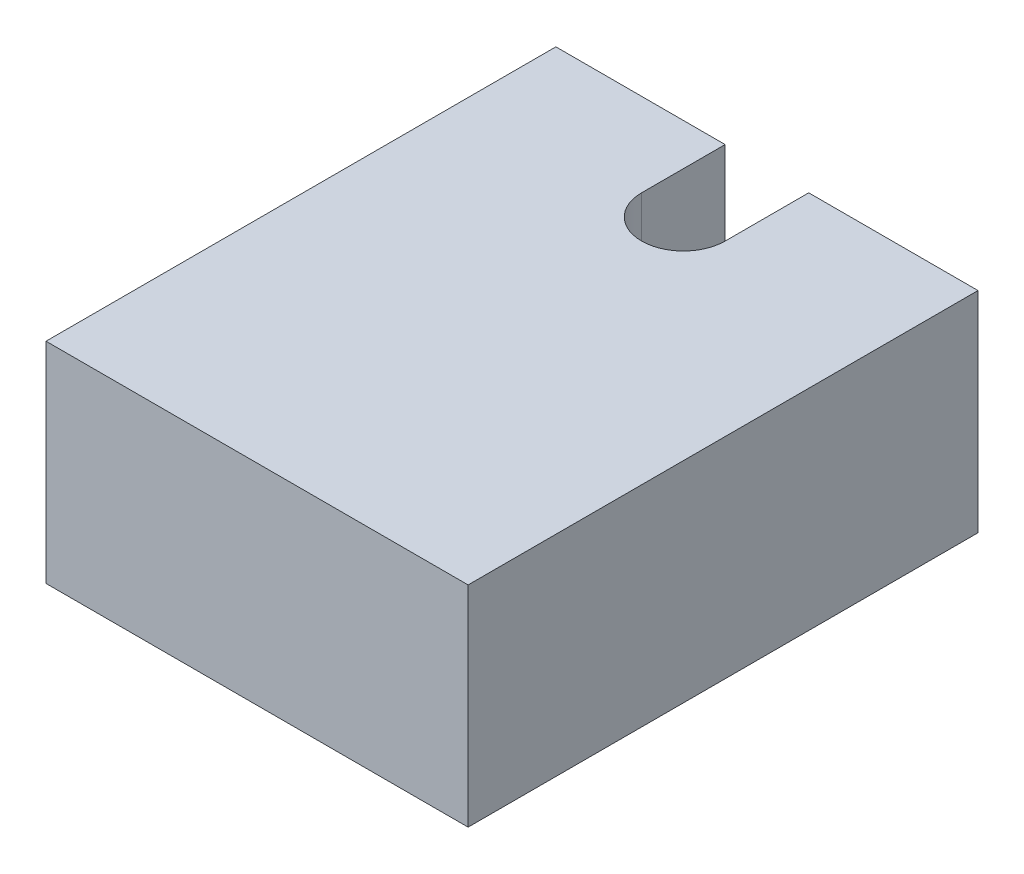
from build123d import *

# Parameters (mm, degrees)
EXTRUSION1_DEPTH = 2.51
ESQUISSE2_R      = 0.25
EXTRUSION2_DEPTH = 1


with BuildPart() as part:
    # Esquisse1 → Extrusion1 (new body)
    with BuildSketch(Plane(origin=(0, 0, 0), x_dir=(1, 0, 0), z_dir=(0, 1, 0))):
        with BuildLine():
            Line((3.025, 5.1), (3.025, 6.1))
            Line((3.025, 6.1), (5.05, 6.1))
            Line((5.05, 6.1), (5.05, 0))
            Line((5.05, 0), (0, 0))
            Line((0, 0), (0, 6.1))
            Line((0, 6.1), (2.025, 6.1))
            Line((2.025, 6.1), (2.025, 5.1))
            ThreePointArc((2.025, 5.1), (2.525, 4.6), (3.025, 5.1))
        make_face()
    extrude(amount=EXTRUSION1_DEPTH)

    # Esquisse2 → Extrusion2 (add)
    with BuildSketch(Plane(origin=(2.025, 0, 0), x_dir=(0, 0, -1), z_dir=(1, 0, 0))):
        with Locations(Location((5.6, 1.255, 0), (0, 0, 180))):
            Circle(ESQUISSE2_R)
    extrude(amount=EXTRUSION2_DEPTH)


solid = part.part
